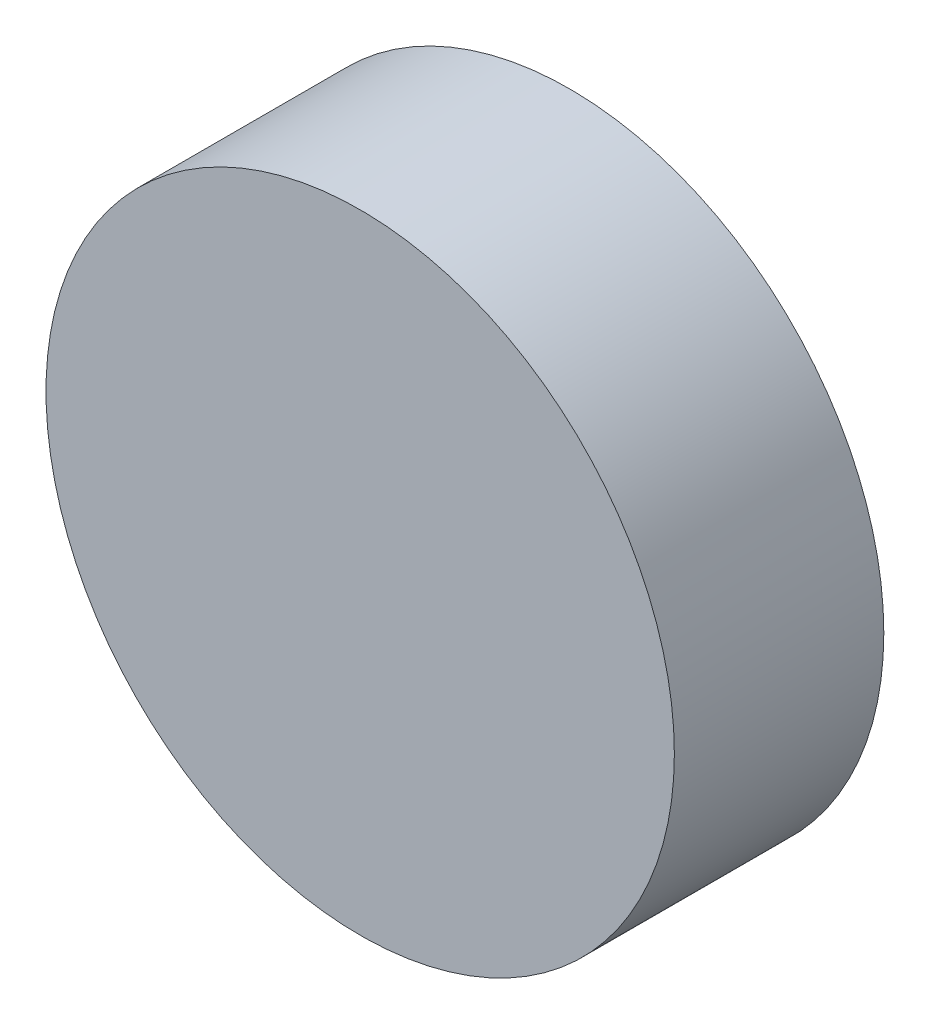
ISO-10303-21;
HEADER;
FILE_DESCRIPTION(('STEP AP214'),'2;1');
FILE_NAME('part.step','',(''),(''),'','','');
FILE_SCHEMA(('AUTOMOTIVE_DESIGN { 1 0 10303 214 1 1 1 1 }'));
ENDSEC;
DATA;
#1=APPLICATION_CONTEXT('core data for automotive mechanical design processes');
#2=APPLICATION_PROTOCOL_DEFINITION('international standard','automotive_design',2000,#1);
#3=PRODUCT_CONTEXT('',#1,'mechanical');
#4=PRODUCT('Part','Part','',(#3));
#5=PRODUCT_RELATED_PRODUCT_CATEGORY('part','',(#4));
#6=PRODUCT_DEFINITION_FORMATION('','',#4);
#7=PRODUCT_DEFINITION_CONTEXT('part definition',#1,'design');
#8=PRODUCT_DEFINITION('design','',#6,#7);
#9=PRODUCT_DEFINITION_SHAPE('','',#8);
#10=(LENGTH_UNIT() NAMED_UNIT(*) SI_UNIT(.MILLI.,.METRE.));
#11=(NAMED_UNIT(*) PLANE_ANGLE_UNIT() SI_UNIT($,.RADIAN.));
#12=(NAMED_UNIT(*) SI_UNIT($,.STERADIAN.) SOLID_ANGLE_UNIT());
#13=UNCERTAINTY_MEASURE_WITH_UNIT(LENGTH_MEASURE(1.E-05),#10,'distance_accuracy_value','');
#14=(GEOMETRIC_REPRESENTATION_CONTEXT(3) GLOBAL_UNCERTAINTY_ASSIGNED_CONTEXT((#13)) GLOBAL_UNIT_ASSIGNED_CONTEXT((#10,
#11,#12)) REPRESENTATION_CONTEXT('',''));
#15=CARTESIAN_POINT('',(0.,0.,0.));
#16=DIRECTION('',(0.,0.,1.));
#17=DIRECTION('',(1.,0.,0.));
#18=AXIS2_PLACEMENT_3D('',#15,#16,#17);
#19=CARTESIAN_POINT('',(0.,0.,3.175));
#20=DIRECTION('',(0.,0.,-1.));
#21=DIRECTION('',(-1.,0.,0.));
#22=AXIS2_PLACEMENT_3D('',#19,#20,#21);
#23=CYLINDRICAL_SURFACE('',#22,4.7625);
#24=CARTESIAN_POINT('',(0.,0.,3.175));
#25=DIRECTION('',(0.,0.,1.));
#26=DIRECTION('',(1.,0.,0.));
#27=AXIS2_PLACEMENT_3D('',#24,#25,#26);
#28=CIRCLE('',#27,4.7625);
#29=CARTESIAN_POINT('',(4.7625,0.,3.175));
#30=VERTEX_POINT('',#29);
#31=EDGE_CURVE('E10',#30,#30,#28,.T.);
#32=ORIENTED_EDGE('',*,*,#31,.F.);
#33=EDGE_LOOP('',(#32));
#34=FACE_BOUND('',#33,.T.);
#35=CARTESIAN_POINT('',(0.,0.,0.));
#36=DIRECTION('',(0.,0.,1.));
#37=DIRECTION('',(1.,0.,0.));
#38=AXIS2_PLACEMENT_3D('',#35,#36,#37);
#39=CIRCLE('',#38,4.7625);
#40=CARTESIAN_POINT('',(4.7625,0.,0.));
#41=VERTEX_POINT('',#40);
#42=EDGE_CURVE('E30',#41,#41,#39,.T.);
#43=ORIENTED_EDGE('',*,*,#42,.T.);
#44=EDGE_LOOP('',(#43));
#45=FACE_BOUND('',#44,.T.);
#46=ADVANCED_FACE('F24',(#34,#45),#23,.T.);
#47=CARTESIAN_POINT('',(0.,0.,3.175));
#48=DIRECTION('',(0.,0.,1.));
#49=DIRECTION('',(1.,0.,0.));
#50=AXIS2_PLACEMENT_3D('',#47,#48,#49);
#51=PLANE('',#50);
#52=ORIENTED_EDGE('',*,*,#31,.T.);
#53=EDGE_LOOP('',(#52));
#54=FACE_BOUND('',#53,.T.);
#55=ADVANCED_FACE('F39',(#54),#51,.T.);
#56=CARTESIAN_POINT('',(0.,0.,0.));
#57=DIRECTION('',(0.,0.,1.));
#58=DIRECTION('',(1.,0.,0.));
#59=AXIS2_PLACEMENT_3D('',#56,#57,#58);
#60=PLANE('',#59);
#61=ORIENTED_EDGE('',*,*,#42,.F.);
#62=EDGE_LOOP('',(#61));
#63=FACE_BOUND('',#62,.T.);
#64=ADVANCED_FACE('F37',(#63),#60,.F.);
#65=CLOSED_SHELL('',(#46,#55,#64));
#66=MANIFOLD_SOLID_BREP('B2',#65);
#67=ADVANCED_BREP_SHAPE_REPRESENTATION('',(#18,#66),#14);
#68=SHAPE_DEFINITION_REPRESENTATION(#9,#67);
ENDSEC;
END-ISO-10303-21;
